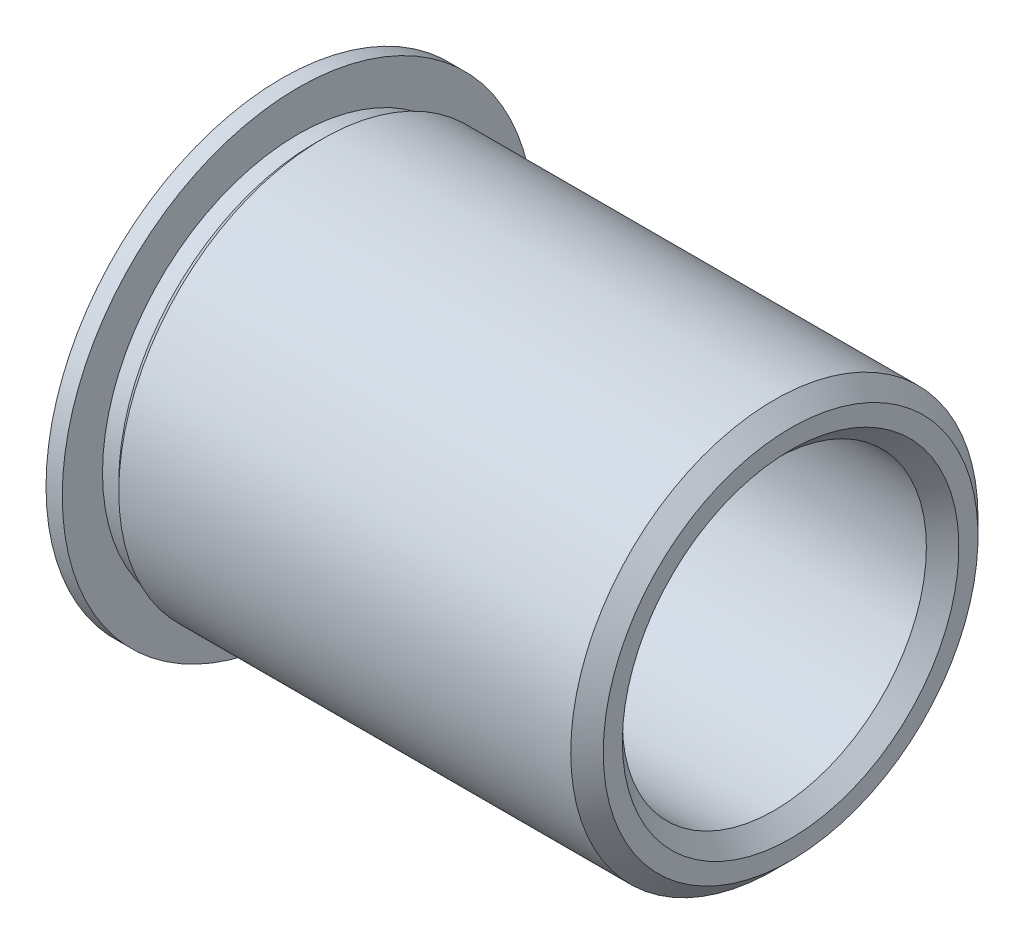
from build123d import *

# Parameters (mm, degrees)
SKETCH3_R          = 2.3749
CUT_EXTRUDE1_DEPTH = 100.509580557
CHAMFER2_SIZE      = 0.254
CHAMFER3_SIZE      = 0.254


with BuildPart() as part:
    # Sketch2 → Revolve3 (revolve)
    with BuildSketch(Plane.XY, mode=Mode.PRIVATE) as revolve3_sk:
        Polygon((-53.041282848, 95.440087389), (-53.041282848, 99.123087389), (-52.787282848, 99.123087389), (-52.787282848, 98.494437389), (-52.533282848, 98.494437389), (-52.406282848, 98.621437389), (-45.345082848, 98.621437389), (-45.091082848, 98.367437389), (-45.091082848, 95.440087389), align=None)
    revolve(revolve3_sk.sketch.rotate(Axis((-53.041282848, 95.440087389, 0), (1, 0, 0)), 90), axis=Axis((-53.041282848, 95.440087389, 0), (1, 0, 0)))

    # Sketch3 → Cut-Extrude1 (cut, through all)
    with BuildSketch(Plane(origin=(-45.091082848, 0, 0), x_dir=(0, 0, -1), z_dir=(1, 0, 0))):
        with Locations((0, 95.440087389)):
            Circle(SKETCH3_R)
    extrude(amount=-CUT_EXTRUDE1_DEPTH, mode=Mode.SUBTRACT)

    # Chamfer2
    chamfer2_edges = [part.edges().sort_by_distance(p)[0] for p in [
        (-53.041282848, 95.440087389, 2.3749),
    ]]
    chamfer(chamfer2_edges, length=CHAMFER2_SIZE)

    # Chamfer3
    chamfer3_edges = [part.edges().sort_by_distance(p)[0] for p in [
        (-45.091082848, 95.440087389, 2.3749),
    ]]
    chamfer(chamfer3_edges, length=CHAMFER3_SIZE)


solid = part.part
